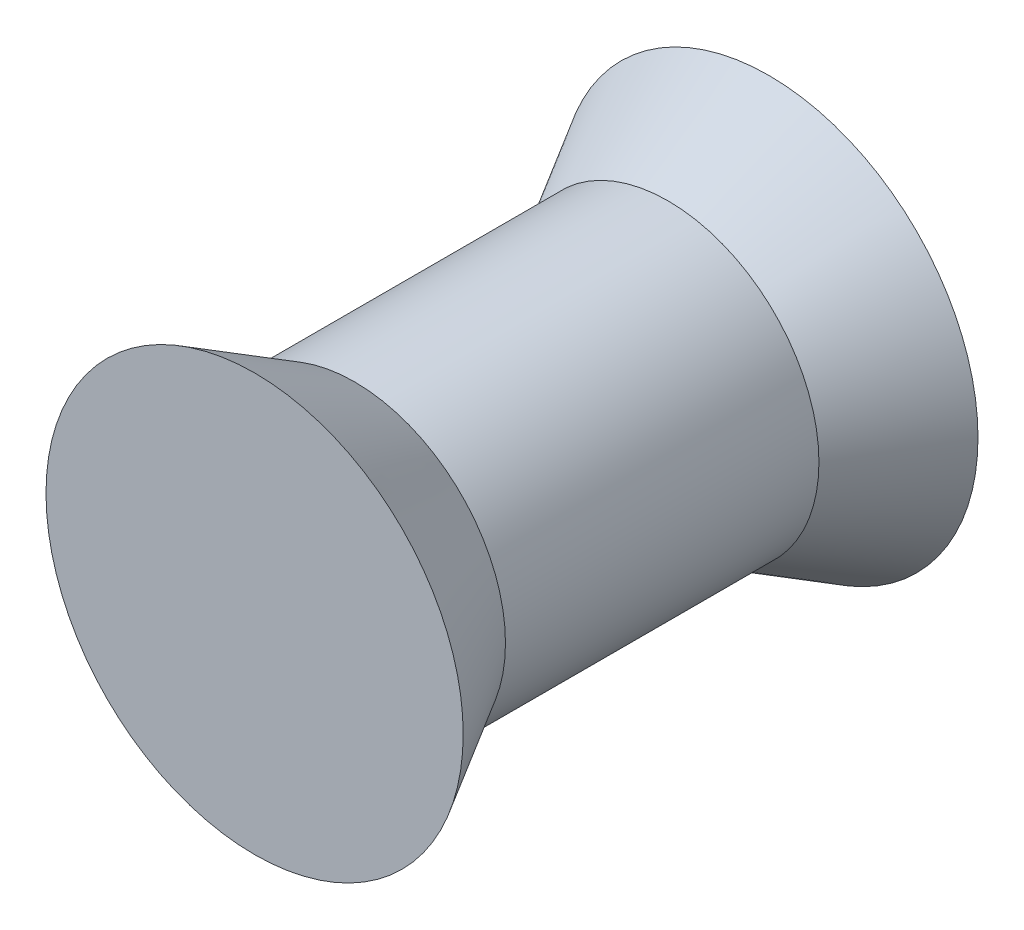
from build123d import *


with BuildPart() as part:
    # Sketch 1 → Revolve 1 (revolve)
    with BuildSketch(Plane(origin=(0, 0, 0), x_dir=(0, 0, -1), z_dir=(1, 0, 0)), mode=Mode.PRIVATE) as revolve_1_sk:
        with BuildLine():
            Line((8.09752, 3.291443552), (6.51002, 2.3749))
            Line((6.51002, 2.3749), (1.5748, 2.3749))
            Line((1.5748, 2.3749), (0, 3.284111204))
            Line((0, 3.284111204), (0, 0))
            Line((0, 0), (9.017151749, 0))
            ThreePointArc((9.017151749, 0), (8.782923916, 1.708751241), (8.09752, 3.291443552))
        make_face()
    revolve(revolve_1_sk.sketch.rotate(Axis((0, 0, 0), (0, 0, -1)), 90), axis=Axis((0, 0, 0), (0, 0, -1)))


solid = part.part
